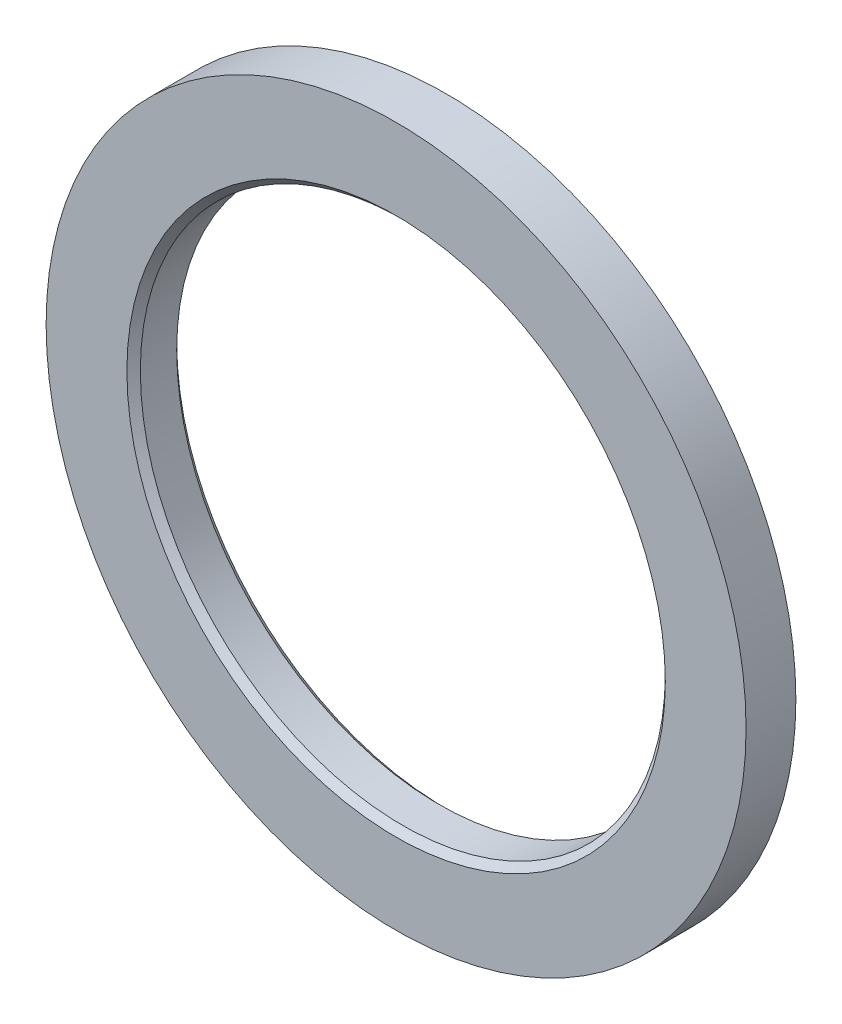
ISO-10303-21;
HEADER;
FILE_DESCRIPTION(('STEP AP214'),'2;1');
FILE_NAME('part.step','',(''),(''),'','','');
FILE_SCHEMA(('AUTOMOTIVE_DESIGN { 1 0 10303 214 1 1 1 1 }'));
ENDSEC;
DATA;
#1=APPLICATION_CONTEXT('core data for automotive mechanical design processes');
#2=APPLICATION_PROTOCOL_DEFINITION('international standard','automotive_design',2000,#1);
#3=PRODUCT_CONTEXT('',#1,'mechanical');
#4=PRODUCT('Part','Part','',(#3));
#5=PRODUCT_RELATED_PRODUCT_CATEGORY('part','',(#4));
#6=PRODUCT_DEFINITION_FORMATION('','',#4);
#7=PRODUCT_DEFINITION_CONTEXT('part definition',#1,'design');
#8=PRODUCT_DEFINITION('design','',#6,#7);
#9=PRODUCT_DEFINITION_SHAPE('','',#8);
#10=(LENGTH_UNIT() NAMED_UNIT(*) SI_UNIT(.MILLI.,.METRE.));
#11=(NAMED_UNIT(*) PLANE_ANGLE_UNIT() SI_UNIT($,.RADIAN.));
#12=(NAMED_UNIT(*) SI_UNIT($,.STERADIAN.) SOLID_ANGLE_UNIT());
#13=UNCERTAINTY_MEASURE_WITH_UNIT(LENGTH_MEASURE(1.E-05),#10,'distance_accuracy_value','');
#14=(GEOMETRIC_REPRESENTATION_CONTEXT(3) GLOBAL_UNCERTAINTY_ASSIGNED_CONTEXT((#13)) GLOBAL_UNIT_ASSIGNED_CONTEXT((#10,
#11,#12)) REPRESENTATION_CONTEXT('',''));
#15=CARTESIAN_POINT('',(0.,0.,0.));
#16=DIRECTION('',(0.,0.,1.));
#17=DIRECTION('',(1.,0.,0.));
#18=AXIS2_PLACEMENT_3D('',#15,#16,#17);
#19=CARTESIAN_POINT('',(1.11022302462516E-13,0.,3.69999999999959));
#20=DIRECTION('',(0.,0.,1.));
#21=DIRECTION('',(0.999999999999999,0.,0.));
#22=AXIS2_PLACEMENT_3D('',#19,#20,#21);
#23=PLANE('',#22);
#24=CARTESIAN_POINT('',(1.11022302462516E-13,0.,3.69999999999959));
#25=DIRECTION('',(0.,0.,1.));
#26=DIRECTION('',(0.999999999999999,0.,0.));
#27=AXIS2_PLACEMENT_3D('',#24,#25,#26);
#28=CIRCLE('',#27,20.);
#29=CARTESIAN_POINT('',(20.0000000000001,0.,3.69999999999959));
#30=VERTEX_POINT('',#29);
#31=EDGE_CURVE('E41',#30,#30,#28,.F.);
#32=ORIENTED_EDGE('',*,*,#31,.T.);
#33=EDGE_LOOP('',(#32));
#34=FACE_BOUND('',#33,.T.);
#35=CARTESIAN_POINT('',(1.11022302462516E-13,0.,3.69999999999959));
#36=DIRECTION('',(0.,0.,1.));
#37=DIRECTION('',(0.999999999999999,0.,0.));
#38=AXIS2_PLACEMENT_3D('',#35,#36,#37);
#39=CIRCLE('',#38,26.);
#40=CARTESIAN_POINT('',(-25.9999999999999,0.,3.69999999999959));
#41=VERTEX_POINT('',#40);
#42=EDGE_CURVE('E54',#41,#41,#39,.T.);
#43=ORIENTED_EDGE('',*,*,#42,.T.);
#44=EDGE_LOOP('',(#43));
#45=FACE_BOUND('',#44,.T.);
#46=ADVANCED_FACE('F34',(#34,#45),#23,.T.);
#47=CARTESIAN_POINT('',(0.,0.,-4.44089209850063E-13));
#48=DIRECTION('',(0.,0.,1.));
#49=DIRECTION('',(0.999999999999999,0.,0.));
#50=AXIS2_PLACEMENT_3D('',#47,#48,#49);
#51=PLANE('',#50);
#52=CARTESIAN_POINT('',(0.,0.,-4.44089209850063E-13));
#53=DIRECTION('',(0.,0.,1.));
#54=DIRECTION('',(0.999999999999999,0.,0.));
#55=AXIS2_PLACEMENT_3D('',#52,#53,#54);
#56=CIRCLE('',#55,20.);
#57=CARTESIAN_POINT('',(-20.,0.,-4.42978986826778E-13));
#58=VERTEX_POINT('',#57);
#59=EDGE_CURVE('E10',#58,#58,#56,.T.);
#60=ORIENTED_EDGE('',*,*,#59,.T.);
#61=EDGE_LOOP('',(#60));
#62=FACE_BOUND('',#61,.T.);
#63=CARTESIAN_POINT('',(0.,0.,-4.44089209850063E-13));
#64=DIRECTION('',(0.,0.,1.));
#65=DIRECTION('',(0.999999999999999,0.,0.));
#66=AXIS2_PLACEMENT_3D('',#63,#64,#65);
#67=CIRCLE('',#66,26.);
#68=CARTESIAN_POINT('',(-25.9999999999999,0.,-4.42354486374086E-13));
#69=VERTEX_POINT('',#68);
#70=EDGE_CURVE('E58',#69,#69,#67,.T.);
#71=ORIENTED_EDGE('',*,*,#70,.F.);
#72=EDGE_LOOP('',(#71));
#73=FACE_BOUND('',#72,.T.);
#74=ADVANCED_FACE('F66',(#62,#73),#51,.F.);
#75=CARTESIAN_POINT('',(1.11022302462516E-13,0.,3.69999999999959));
#76=DIRECTION('',(0.,0.,-1.));
#77=DIRECTION('',(-0.999999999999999,0.,0.));
#78=AXIS2_PLACEMENT_3D('',#75,#76,#77);
#79=CYLINDRICAL_SURFACE('',#78,26.);
#80=CARTESIAN_POINT('',(-25.9999999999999,0.,3.69999999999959));
#81=CARTESIAN_POINT('',(-25.9999999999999,0.,3.66145833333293));
#82=CARTESIAN_POINT('',(-25.9999999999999,0.,3.62291666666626));
#83=CARTESIAN_POINT('',(-25.9999999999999,0.,3.54583333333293));
#84=CARTESIAN_POINT('',(-25.9999999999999,0.,3.50729166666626));
#85=CARTESIAN_POINT('',(-25.9999999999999,0.,3.43020833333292));
#86=CARTESIAN_POINT('',(-25.9999999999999,0.,3.39166666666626));
#87=CARTESIAN_POINT('',(-25.9999999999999,0.,3.31458333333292));
#88=CARTESIAN_POINT('',(-25.9999999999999,0.,3.27604166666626));
#89=CARTESIAN_POINT('',(-25.9999999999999,0.,3.19895833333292));
#90=CARTESIAN_POINT('',(-25.9999999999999,0.,3.16041666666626));
#91=CARTESIAN_POINT('',(-25.9999999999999,0.,3.08333333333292));
#92=CARTESIAN_POINT('',(-25.9999999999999,0.,3.04479166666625));
#93=CARTESIAN_POINT('',(-25.9999999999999,0.,2.96770833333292));
#94=CARTESIAN_POINT('',(-25.9999999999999,0.,2.92916666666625));
#95=CARTESIAN_POINT('',(-25.9999999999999,0.,2.85208333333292));
#96=CARTESIAN_POINT('',(-25.9999999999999,0.,2.81354166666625));
#97=CARTESIAN_POINT('',(-25.9999999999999,0.,2.73645833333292));
#98=CARTESIAN_POINT('',(-25.9999999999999,0.,2.69791666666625));
#99=CARTESIAN_POINT('',(-25.9999999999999,0.,2.62083333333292));
#100=CARTESIAN_POINT('',(-25.9999999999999,0.,2.58229166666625));
#101=CARTESIAN_POINT('',(-25.9999999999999,0.,2.50520833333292));
#102=CARTESIAN_POINT('',(-25.9999999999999,0.,2.46666666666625));
#103=CARTESIAN_POINT('',(-25.9999999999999,0.,2.38958333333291));
#104=CARTESIAN_POINT('',(-25.9999999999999,0.,2.35104166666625));
#105=CARTESIAN_POINT('',(-25.9999999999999,0.,2.27395833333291));
#106=CARTESIAN_POINT('',(-25.9999999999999,0.,2.23541666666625));
#107=CARTESIAN_POINT('',(-25.9999999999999,0.,2.15833333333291));
#108=CARTESIAN_POINT('',(-25.9999999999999,0.,2.11979166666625));
#109=CARTESIAN_POINT('',(-25.9999999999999,0.,2.04270833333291));
#110=CARTESIAN_POINT('',(-25.9999999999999,0.,2.00416666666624));
#111=CARTESIAN_POINT('',(-25.9999999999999,0.,1.92708333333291));
#112=CARTESIAN_POINT('',(-25.9999999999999,0.,1.88854166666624));
#113=CARTESIAN_POINT('',(-25.9999999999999,0.,1.81145833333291));
#114=CARTESIAN_POINT('',(-25.9999999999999,0.,1.77291666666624));
#115=CARTESIAN_POINT('',(-25.9999999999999,0.,1.69583333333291));
#116=CARTESIAN_POINT('',(-25.9999999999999,0.,1.65729166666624));
#117=CARTESIAN_POINT('',(-25.9999999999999,0.,1.58020833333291));
#118=CARTESIAN_POINT('',(-25.9999999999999,0.,1.54166666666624));
#119=CARTESIAN_POINT('',(-25.9999999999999,0.,1.46458333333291));
#120=CARTESIAN_POINT('',(-25.9999999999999,0.,1.42604166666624));
#121=CARTESIAN_POINT('',(-25.9999999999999,0.,1.3489583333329));
#122=CARTESIAN_POINT('',(-25.9999999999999,0.,1.31041666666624));
#123=CARTESIAN_POINT('',(-25.9999999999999,0.,1.2333333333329));
#124=CARTESIAN_POINT('',(-25.9999999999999,0.,1.19479166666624));
#125=CARTESIAN_POINT('',(-25.9999999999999,0.,1.1177083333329));
#126=CARTESIAN_POINT('',(-25.9999999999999,0.,1.07916666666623));
#127=CARTESIAN_POINT('',(-25.9999999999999,0.,1.0020833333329));
#128=CARTESIAN_POINT('',(-25.9999999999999,0.,0.963541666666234));
#129=CARTESIAN_POINT('',(-25.9999999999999,0.,0.8864583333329));
#130=CARTESIAN_POINT('',(-25.9999999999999,0.,0.847916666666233));
#131=CARTESIAN_POINT('',(-25.9999999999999,0.,0.770833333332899));
#132=CARTESIAN_POINT('',(-25.9999999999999,0.,0.732291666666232));
#133=CARTESIAN_POINT('',(-25.9999999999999,0.,0.655208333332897));
#134=CARTESIAN_POINT('',(-25.9999999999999,0.,0.61666666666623));
#135=CARTESIAN_POINT('',(-25.9999999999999,0.,0.539583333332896));
#136=CARTESIAN_POINT('',(-25.9999999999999,0.,0.501041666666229));
#137=CARTESIAN_POINT('',(-25.9999999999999,0.,0.423958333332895));
#138=CARTESIAN_POINT('',(-25.9999999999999,0.,0.385416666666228));
#139=CARTESIAN_POINT('',(-25.9999999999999,0.,0.308333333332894));
#140=CARTESIAN_POINT('',(-25.9999999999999,0.,0.269791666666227));
#141=CARTESIAN_POINT('',(-25.9999999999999,0.,0.192708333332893));
#142=CARTESIAN_POINT('',(-25.9999999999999,0.,0.154166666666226));
#143=CARTESIAN_POINT('',(-25.9999999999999,0.,0.0770833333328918));
#144=CARTESIAN_POINT('',(-25.9999999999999,0.,0.0385416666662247));
#145=CARTESIAN_POINT('',(-25.9999999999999,0.,-4.42354486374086E-13));
#146=B_SPLINE_CURVE_WITH_KNOTS('',3,(#80,#81,#82,#83,#84,#85,#86,#87,#88,#89,#90,#91,#92,#93,
#94,#95,#96,#97,#98,#99,#100,#101,#102,#103,#104,#105,#106,#107,#108,#109,#110,#111,#112,#113,
#114,#115,#116,#117,#118,#119,#120,#121,#122,#123,#124,#125,#126,#127,#128,#129,#130,#131,#132,
#133,#134,#135,#136,#137,#138,#139,#140,#141,#142,#143,#144,#145),.UNSPECIFIED.,.F.,.F.,(4,2,2,
2,2,2,2,2,2,2,2,2,2,2,2,2,2,2,2,2,2,2,2,2,2,2,2,2,2,2,2,2,4),(0.,0.115625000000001,
0.231250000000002,0.346875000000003,0.462500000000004,0.578125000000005,0.693750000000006,
0.809375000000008,0.925000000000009,1.04062500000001,1.15625000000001,1.27187500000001,
1.38750000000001,1.50312500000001,1.61875000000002,1.73437500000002,1.85000000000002,
1.96562500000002,2.08125000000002,2.19687500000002,2.31250000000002,2.42812500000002,
2.54375000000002,2.65937500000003,2.77500000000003,2.89062500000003,3.00625000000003,
3.12187500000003,3.23750000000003,3.35312500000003,3.46875000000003,3.58437500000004,
3.70000000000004),.UNSPECIFIED.);
#147=EDGE_CURVE('BSEAM36',#41,#69,#146,.T.);
#148=ORIENTED_EDGE('',*,*,#42,.F.);
#149=ORIENTED_EDGE('',*,*,#70,.T.);
#150=ORIENTED_EDGE('',*,*,#147,.T.);
#151=ORIENTED_EDGE('',*,*,#147,.F.);
#152=EDGE_LOOP('',(#148,#150,#149,#151));
#153=FACE_BOUND('',#152,.T.);
#154=ADVANCED_FACE('F36',(#153),#79,.T.);
#155=CARTESIAN_POINT('',(1.11022302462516E-13,0.,3.69999999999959));
#156=DIRECTION('',(0.,0.,-1.));
#157=DIRECTION('',(-0.999999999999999,0.,0.));
#158=AXIS2_PLACEMENT_3D('',#155,#156,#157);
#159=CYLINDRICAL_SURFACE('',#158,19.5);
#160=CARTESIAN_POINT('',(0.,0.,3.19999999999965));
#161=DIRECTION('',(0.,0.,1.));
#162=DIRECTION('',(0.999999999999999,0.,0.));
#163=AXIS2_PLACEMENT_3D('',#160,#161,#162);
#164=CIRCLE('',#163,19.5);
#165=CARTESIAN_POINT('',(-19.4999999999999,0.,3.19999999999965));
#166=VERTEX_POINT('',#165);
#167=EDGE_CURVE('E45',#166,#166,#164,.T.);
#168=CARTESIAN_POINT('',(-2.22044604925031E-13,-3.05311331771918E-13,0.499999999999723));
#169=DIRECTION('',(0.,0.,1.));
#170=DIRECTION('',(0.999999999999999,0.,0.));
#171=AXIS2_PLACEMENT_3D('',#168,#169,#170);
#172=CIRCLE('',#171,19.5);
#173=CARTESIAN_POINT('',(-19.4999999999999,0.,0.499999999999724));
#174=VERTEX_POINT('',#173);
#175=EDGE_CURVE('E49',#174,#174,#172,.F.);
#176=CARTESIAN_POINT('',(-19.4999999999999,0.,3.19999999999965));
#177=CARTESIAN_POINT('',(-19.4999999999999,0.,3.17187499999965));
#178=CARTESIAN_POINT('',(-19.4999999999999,0.,3.14374999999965));
#179=CARTESIAN_POINT('',(-19.4999999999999,0.,3.08749999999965));
#180=CARTESIAN_POINT('',(-19.4999999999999,0.,3.05937499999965));
#181=CARTESIAN_POINT('',(-19.4999999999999,0.,3.00312499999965));
#182=CARTESIAN_POINT('',(-19.4999999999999,0.,2.97499999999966));
#183=CARTESIAN_POINT('',(-19.4999999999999,0.,2.91874999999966));
#184=CARTESIAN_POINT('',(-19.4999999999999,0.,2.89062499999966));
#185=CARTESIAN_POINT('',(-19.4999999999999,0.,2.83437499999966));
#186=CARTESIAN_POINT('',(-19.4999999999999,0.,2.80624999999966));
#187=CARTESIAN_POINT('',(-19.4999999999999,0.,2.74999999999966));
#188=CARTESIAN_POINT('',(-19.4999999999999,0.,2.72187499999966));
#189=CARTESIAN_POINT('',(-19.4999999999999,0.,2.66562499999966));
#190=CARTESIAN_POINT('',(-19.4999999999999,0.,2.63749999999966));
#191=CARTESIAN_POINT('',(-19.4999999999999,0.,2.58124999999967));
#192=CARTESIAN_POINT('',(-19.4999999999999,0.,2.55312499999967));
#193=CARTESIAN_POINT('',(-19.4999999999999,0.,2.49687499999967));
#194=CARTESIAN_POINT('',(-19.4999999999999,0.,2.46874999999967));
#195=CARTESIAN_POINT('',(-19.4999999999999,0.,2.41249999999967));
#196=CARTESIAN_POINT('',(-19.4999999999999,0.,2.38437499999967));
#197=CARTESIAN_POINT('',(-19.4999999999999,0.,2.32812499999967));
#198=CARTESIAN_POINT('',(-19.4999999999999,0.,2.29999999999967));
#199=CARTESIAN_POINT('',(-19.4999999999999,0.,2.24374999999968));
#200=CARTESIAN_POINT('',(-19.4999999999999,0.,2.21562499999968));
#201=CARTESIAN_POINT('',(-19.4999999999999,0.,2.15937499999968));
#202=CARTESIAN_POINT('',(-19.4999999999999,0.,2.13124999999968));
#203=CARTESIAN_POINT('',(-19.4999999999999,0.,2.07499999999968));
#204=CARTESIAN_POINT('',(-19.4999999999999,0.,2.04687499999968));
#205=CARTESIAN_POINT('',(-19.4999999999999,0.,1.99062499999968));
#206=CARTESIAN_POINT('',(-19.4999999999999,0.,1.96249999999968));
#207=CARTESIAN_POINT('',(-19.4999999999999,0.,1.90624999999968));
#208=CARTESIAN_POINT('',(-19.4999999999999,0.,1.87812499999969));
#209=CARTESIAN_POINT('',(-19.4999999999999,0.,1.82187499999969));
#210=CARTESIAN_POINT('',(-19.4999999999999,0.,1.79374999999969));
#211=CARTESIAN_POINT('',(-19.4999999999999,0.,1.73749999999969));
#212=CARTESIAN_POINT('',(-19.4999999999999,0.,1.70937499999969));
#213=CARTESIAN_POINT('',(-19.4999999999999,0.,1.65312499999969));
#214=CARTESIAN_POINT('',(-19.4999999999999,0.,1.62499999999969));
#215=CARTESIAN_POINT('',(-19.4999999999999,0.,1.56874999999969));
#216=CARTESIAN_POINT('',(-19.4999999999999,0.,1.5406249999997));
#217=CARTESIAN_POINT('',(-19.4999999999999,0.,1.4843749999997));
#218=CARTESIAN_POINT('',(-19.4999999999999,0.,1.4562499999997));
#219=CARTESIAN_POINT('',(-19.4999999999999,0.,1.3999999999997));
#220=CARTESIAN_POINT('',(-19.4999999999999,0.,1.3718749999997));
#221=CARTESIAN_POINT('',(-19.4999999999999,0.,1.3156249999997));
#222=CARTESIAN_POINT('',(-19.4999999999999,0.,1.2874999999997));
#223=CARTESIAN_POINT('',(-19.4999999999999,0.,1.2312499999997));
#224=CARTESIAN_POINT('',(-19.4999999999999,0.,1.2031249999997));
#225=CARTESIAN_POINT('',(-19.4999999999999,0.,1.14687499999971));
#226=CARTESIAN_POINT('',(-19.4999999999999,0.,1.11874999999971));
#227=CARTESIAN_POINT('',(-19.4999999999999,0.,1.06249999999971));
#228=CARTESIAN_POINT('',(-19.4999999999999,0.,1.03437499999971));
#229=CARTESIAN_POINT('',(-19.4999999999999,0.,0.978124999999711));
#230=CARTESIAN_POINT('',(-19.4999999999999,0.,0.949999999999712));
#231=CARTESIAN_POINT('',(-19.4999999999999,0.,0.893749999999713));
#232=CARTESIAN_POINT('',(-19.4999999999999,0.,0.865624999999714));
#233=CARTESIAN_POINT('',(-19.4999999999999,0.,0.809374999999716));
#234=CARTESIAN_POINT('',(-19.4999999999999,0.,0.781249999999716));
#235=CARTESIAN_POINT('',(-19.4999999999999,0.,0.724999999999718));
#236=CARTESIAN_POINT('',(-19.4999999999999,0.,0.696874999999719));
#237=CARTESIAN_POINT('',(-19.4999999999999,0.,0.64062499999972));
#238=CARTESIAN_POINT('',(-19.4999999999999,0.,0.612499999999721));
#239=CARTESIAN_POINT('',(-19.4999999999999,0.,0.556249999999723));
#240=CARTESIAN_POINT('',(-19.4999999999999,0.,0.528124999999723));
#241=CARTESIAN_POINT('',(-19.4999999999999,0.,0.499999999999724));
#242=B_SPLINE_CURVE_WITH_KNOTS('',3,(#176,#177,#178,#179,#180,#181,#182,#183,#184,#185,#186,
#187,#188,#189,#190,#191,#192,#193,#194,#195,#196,#197,#198,#199,#200,#201,#202,#203,#204,#205,
#206,#207,#208,#209,#210,#211,#212,#213,#214,#215,#216,#217,#218,#219,#220,#221,#222,#223,#224,
#225,#226,#227,#228,#229,#230,#231,#232,#233,#234,#235,#236,#237,#238,#239,#240,#241),
.UNSPECIFIED.,.F.,.F.,(4,2,2,2,2,2,2,2,2,2,2,2,2,2,2,2,2,2,2,2,2,2,2,2,2,2,2,2,2,2,2,2,4),(0.,
0.0843749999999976,0.168749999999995,0.253124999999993,0.337499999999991,0.421874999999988,
0.506249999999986,0.590624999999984,0.674999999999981,0.759374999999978,0.843749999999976,
0.928124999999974,1.01249999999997,1.09687499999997,1.18124999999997,1.26562499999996,
1.34999999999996,1.43437499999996,1.51874999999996,1.60312499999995,1.68749999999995,
1.77187499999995,1.85624999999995,1.94062499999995,2.02499999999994,2.10937499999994,
2.19374999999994,2.27812499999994,2.36249999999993,2.44687499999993,2.53124999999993,
2.61562499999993,2.69999999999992),.UNSPECIFIED.);
#243=EDGE_CURVE('BSEAM73',#166,#174,#242,.T.);
#244=ORIENTED_EDGE('',*,*,#167,.T.);
#245=ORIENTED_EDGE('',*,*,#175,.T.);
#246=ORIENTED_EDGE('',*,*,#243,.T.);
#247=ORIENTED_EDGE('',*,*,#243,.F.);
#248=EDGE_LOOP('',(#244,#246,#245,#247));
#249=FACE_BOUND('',#248,.T.);
#250=ADVANCED_FACE('F73',(#249),#159,.F.);
#251=CARTESIAN_POINT('',(0.,0.,3.19999999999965));
#252=DIRECTION('',(0.,0.,1.));
#253=DIRECTION('',(0.999999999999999,0.,0.));
#254=AXIS2_PLACEMENT_3D('',#251,#252,#253);
#255=CONICAL_SURFACE('',#254,19.5,0.785398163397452);
#256=ORIENTED_EDGE('',*,*,#31,.F.);
#257=EDGE_LOOP('',(#256));
#258=FACE_BOUND('',#257,.T.);
#259=ORIENTED_EDGE('',*,*,#167,.F.);
#260=EDGE_LOOP('',(#259));
#261=FACE_BOUND('',#260,.T.);
#262=ADVANCED_FACE('F78',(#258,#261),#255,.F.);
#263=CARTESIAN_POINT('',(0.,0.,-4.44089209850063E-13));
#264=DIRECTION('',(0.,0.,-1.));
#265=DIRECTION('',(-0.999999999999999,0.,0.));
#266=AXIS2_PLACEMENT_3D('',#263,#264,#265);
#267=CONICAL_SURFACE('',#266,20.,0.785398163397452);
#268=CARTESIAN_POINT('',(-19.4999999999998,0.,0.499999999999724));
#269=CARTESIAN_POINT('',(-19.5052083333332,0.,0.494791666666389));
#270=CARTESIAN_POINT('',(-19.5104166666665,0.,0.489583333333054));
#271=CARTESIAN_POINT('',(-19.5208333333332,0.,0.479166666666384));
#272=CARTESIAN_POINT('',(-19.5260416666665,0.,0.473958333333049));
#273=CARTESIAN_POINT('',(-19.5364583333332,0.,0.463541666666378));
#274=CARTESIAN_POINT('',(-19.5416666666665,0.,0.458333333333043));
#275=CARTESIAN_POINT('',(-19.5520833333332,0.,0.447916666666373));
#276=CARTESIAN_POINT('',(-19.5572916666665,0.,0.442708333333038));
#277=CARTESIAN_POINT('',(-19.5677083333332,0.,0.432291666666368));
#278=CARTESIAN_POINT('',(-19.5729166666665,0.,0.427083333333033));
#279=CARTESIAN_POINT('',(-19.5833333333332,0.,0.416666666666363));
#280=CARTESIAN_POINT('',(-19.5885416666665,0.,0.411458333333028));
#281=CARTESIAN_POINT('',(-19.5989583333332,0.,0.401041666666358));
#282=CARTESIAN_POINT('',(-19.6041666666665,0.,0.395833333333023));
#283=CARTESIAN_POINT('',(-19.6145833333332,0.,0.385416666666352));
#284=CARTESIAN_POINT('',(-19.6197916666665,0.,0.380208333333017));
#285=CARTESIAN_POINT('',(-19.6302083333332,0.,0.369791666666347));
#286=CARTESIAN_POINT('',(-19.6354166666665,0.,0.364583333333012));
#287=CARTESIAN_POINT('',(-19.6458333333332,0.,0.354166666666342));
#288=CARTESIAN_POINT('',(-19.6510416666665,0.,0.348958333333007));
#289=CARTESIAN_POINT('',(-19.6614583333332,0.,0.338541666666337));
#290=CARTESIAN_POINT('',(-19.6666666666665,0.,0.333333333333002));
#291=CARTESIAN_POINT('',(-19.6770833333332,0.,0.322916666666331));
#292=CARTESIAN_POINT('',(-19.6822916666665,0.,0.317708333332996));
#293=CARTESIAN_POINT('',(-19.6927083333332,0.,0.307291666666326));
#294=CARTESIAN_POINT('',(-19.6979166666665,0.,0.302083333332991));
#295=CARTESIAN_POINT('',(-19.7083333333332,0.,0.291666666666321));
#296=CARTESIAN_POINT('',(-19.7135416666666,0.,0.286458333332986));
#297=CARTESIAN_POINT('',(-19.7239583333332,0.,0.276041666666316));
#298=CARTESIAN_POINT('',(-19.7291666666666,0.,0.270833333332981));
#299=CARTESIAN_POINT('',(-19.7395833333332,0.,0.260416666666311));
#300=CARTESIAN_POINT('',(-19.7447916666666,0.,0.255208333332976));
#301=CARTESIAN_POINT('',(-19.7552083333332,0.,0.244791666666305));
#302=CARTESIAN_POINT('',(-19.7604166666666,0.,0.23958333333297));
#303=CARTESIAN_POINT('',(-19.7708333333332,0.,0.2291666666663));
#304=CARTESIAN_POINT('',(-19.7760416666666,0.,0.223958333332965));
#305=CARTESIAN_POINT('',(-19.7864583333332,0.,0.213541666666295));
#306=CARTESIAN_POINT('',(-19.7916666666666,0.,0.20833333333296));
#307=CARTESIAN_POINT('',(-19.8020833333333,0.,0.19791666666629));
#308=CARTESIAN_POINT('',(-19.8072916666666,0.,0.192708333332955));
#309=CARTESIAN_POINT('',(-19.8177083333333,0.,0.182291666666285));
#310=CARTESIAN_POINT('',(-19.8229166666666,0.,0.177083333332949));
#311=CARTESIAN_POINT('',(-19.8333333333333,0.,0.166666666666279));
#312=CARTESIAN_POINT('',(-19.8385416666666,0.,0.161458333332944));
#313=CARTESIAN_POINT('',(-19.8489583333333,0.,0.151041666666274));
#314=CARTESIAN_POINT('',(-19.8541666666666,0.,0.145833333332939));
#315=CARTESIAN_POINT('',(-19.8645833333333,0.,0.135416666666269));
#316=CARTESIAN_POINT('',(-19.8697916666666,0.,0.130208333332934));
#317=CARTESIAN_POINT('',(-19.8802083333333,0.,0.119791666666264));
#318=CARTESIAN_POINT('',(-19.8854166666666,0.,0.114583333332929));
#319=CARTESIAN_POINT('',(-19.8958333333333,0.,0.104166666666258));
#320=CARTESIAN_POINT('',(-19.9010416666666,0.,0.0989583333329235));
#321=CARTESIAN_POINT('',(-19.9114583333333,0.,0.0885416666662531));
#322=CARTESIAN_POINT('',(-19.9166666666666,0.,0.0833333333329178));
#323=CARTESIAN_POINT('',(-19.9270833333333,0.,0.0729166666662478));
#324=CARTESIAN_POINT('',(-19.9322916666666,0.,0.0677083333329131));
#325=CARTESIAN_POINT('',(-19.9427083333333,0.,0.0572916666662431));
#326=CARTESIAN_POINT('',(-19.9479166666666,0.,0.0520833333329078));
#327=CARTESIAN_POINT('',(-19.9583333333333,0.,0.0416666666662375));
#328=CARTESIAN_POINT('',(-19.9635416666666,0.,0.0364583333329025));
#329=CARTESIAN_POINT('',(-19.9739583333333,0.,0.0260416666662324));
#330=CARTESIAN_POINT('',(-19.9791666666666,0.,0.0208333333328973));
#331=CARTESIAN_POINT('',(-19.9895833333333,0.,0.0104166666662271));
#332=CARTESIAN_POINT('',(-19.9947916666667,0.,0.00520833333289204));
#333=CARTESIAN_POINT('',(-20.,0.,-4.43005007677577E-13));
#334=B_SPLINE_CURVE_WITH_KNOTS('',3,(#268,#269,#270,#271,#272,#273,#274,#275,#276,#277,#278,
#279,#280,#281,#282,#283,#284,#285,#286,#287,#288,#289,#290,#291,#292,#293,#294,#295,#296,#297,
#298,#299,#300,#301,#302,#303,#304,#305,#306,#307,#308,#309,#310,#311,#312,#313,#314,#315,#316,
#317,#318,#319,#320,#321,#322,#323,#324,#325,#326,#327,#328,#329,#330,#331,#332,#333),
.UNSPECIFIED.,.F.,.F.,(4,2,2,2,2,2,2,2,2,2,2,2,2,2,2,2,2,2,2,2,2,2,2,2,2,2,2,2,2,2,2,2,4),(0.,
0.022097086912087,0.044194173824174,0.066291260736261,0.088388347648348,0.110485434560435,
0.132582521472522,0.154679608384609,0.176776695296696,0.198873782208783,0.22097086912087,
0.243067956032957,0.265165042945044,0.287262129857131,0.309359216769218,0.331456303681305,
0.353553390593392,0.375650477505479,0.397747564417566,0.419844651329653,0.44194173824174,
0.464038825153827,0.486135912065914,0.508232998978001,0.530330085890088,0.552427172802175,
0.574524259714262,0.596621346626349,0.618718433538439,0.640815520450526,0.662912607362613,
0.6850096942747,0.707106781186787),.UNSPECIFIED.);
#335=EDGE_CURVE('BSEAM82',#174,#58,#334,.T.);
#336=ORIENTED_EDGE('',*,*,#175,.F.);
#337=ORIENTED_EDGE('',*,*,#59,.F.);
#338=ORIENTED_EDGE('',*,*,#335,.T.);
#339=ORIENTED_EDGE('',*,*,#335,.F.);
#340=EDGE_LOOP('',(#336,#338,#337,#339));
#341=FACE_BOUND('',#340,.T.);
#342=ADVANCED_FACE('F82',(#341),#267,.F.);
#343=CLOSED_SHELL('',(#46,#74,#154,#250,#262,#342));
#344=MANIFOLD_SOLID_BREP('B2',#343);
#345=ADVANCED_BREP_SHAPE_REPRESENTATION('',(#18,#344),#14);
#346=SHAPE_DEFINITION_REPRESENTATION(#9,#345);
ENDSEC;
END-ISO-10303-21;
